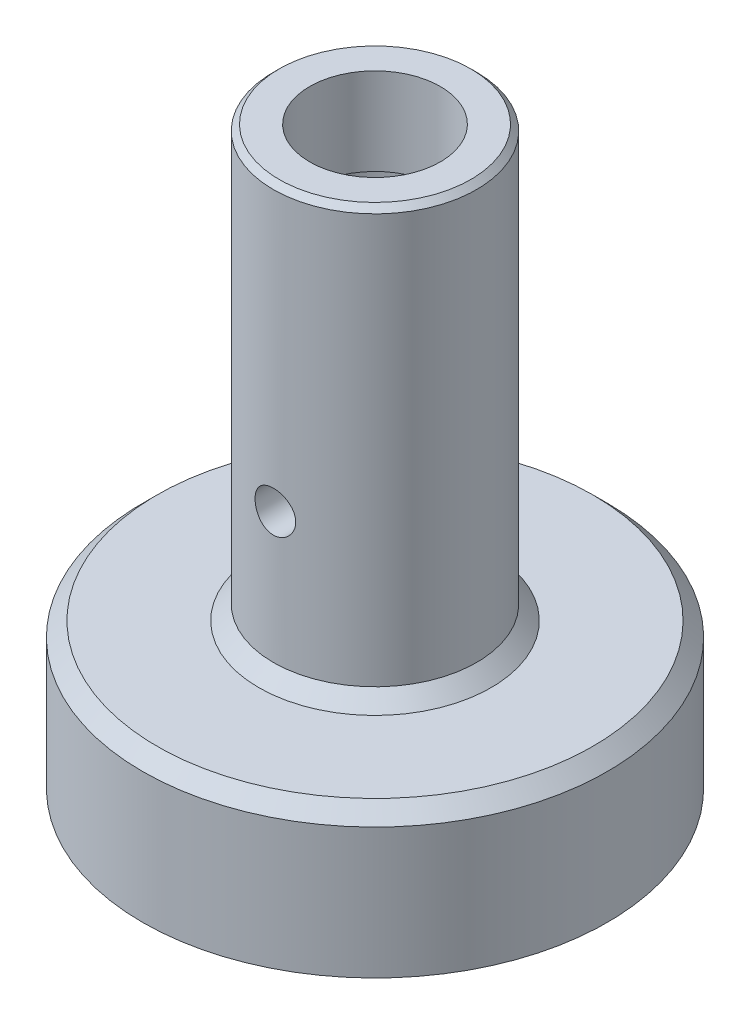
from build123d import *

# Parameters (mm, degrees)
CHANFREIN1_SIZE         = 5
CHANFREIN2_SIZE         = 5
CHANFREIN3_SIZE         = 2
ESQUISSE2_R             = 7
ENL_V_MAT_EXTRU_1_DEPTH = 229.043855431


with BuildPart() as part:
    # Esquisse1 → R_volution1 (revolve)
    with BuildSketch(Plane.XY, mode=Mode.PRIVATE) as r_volution1_sk:
        Polygon((35, -158), (35, -178), (25, -178), (25, -30), (22.5, -30), (22.5, 0), (35, 0), (35, -148), (80, -148), (80, -198), (77, -198), (77, -158), align=None)
    revolve(r_volution1_sk.sketch.rotate(Axis((0, 66.792518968, 0), (0, -1, 0)), 90), axis=Axis((0, 66.792518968, 0), (0, -1, 0)))

    # Chanfrein1
    chanfrein1_edges = [part.edges().sort_by_distance(p)[0] for p in [
        (0, -148, -80),
    ]]
    chamfer(chanfrein1_edges, length=CHANFREIN1_SIZE)

    # Chanfrein2
    chanfrein2_edges = [part.edges().sort_by_distance(p)[0] for p in [
        (0, -148, -35),
    ]]
    chamfer(chanfrein2_edges, length=CHANFREIN2_SIZE)

    # Chanfrein3
    chanfrein3_edges = [part.edges().sort_by_distance(p)[0] for p in [
        (0, 0, -35),
        (0, -178, -25),
    ]]
    chamfer(chanfrein3_edges, length=CHANFREIN3_SIZE)

    # Esquisse2 → Enl_v. mat.-Extru.1 (cut, through all)
    with BuildSketch(Plane.XY):
        with Locations(Location((0, -98, 0), (0, 0, 270))):
            Circle(ESQUISSE2_R)
    extrude(amount=ENL_V_MAT_EXTRU_1_DEPTH, mode=Mode.SUBTRACT)


solid = part.part
